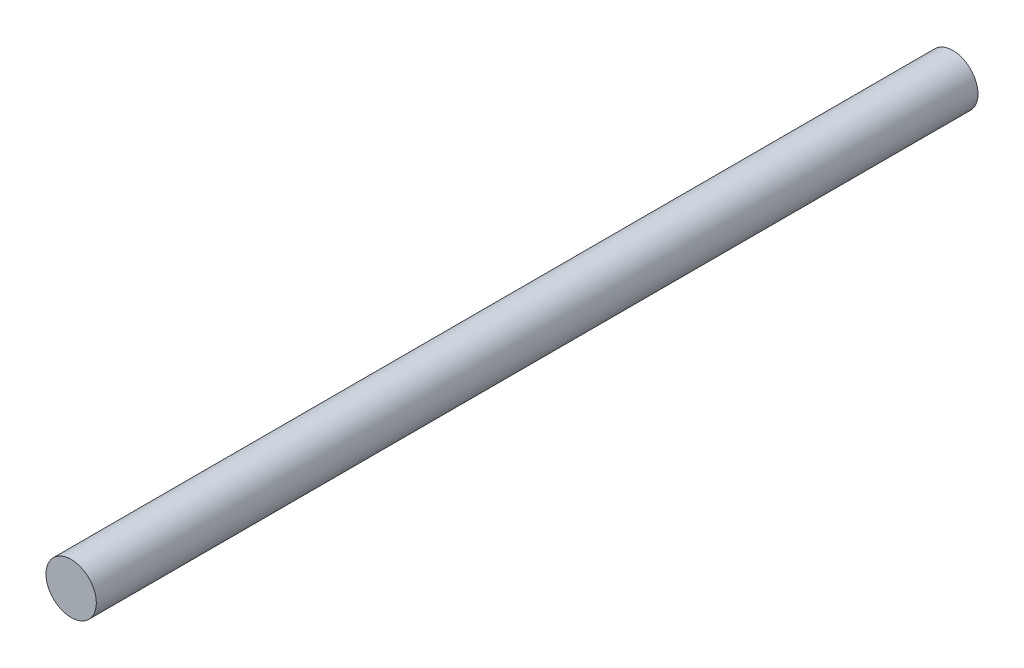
from build123d import *

# Parameters (mm, degrees)
SKETCH1_R           = 1
BOSS_EXTRUDE1_DEPTH = 17.5


with BuildPart() as part:
    # Sketch1 → Boss-Extrude1 (new, symmetric)
    with BuildSketch(Plane.XY):
        Circle(SKETCH1_R)
    extrude(amount=BOSS_EXTRUDE1_DEPTH, both=True)


solid = part.part
